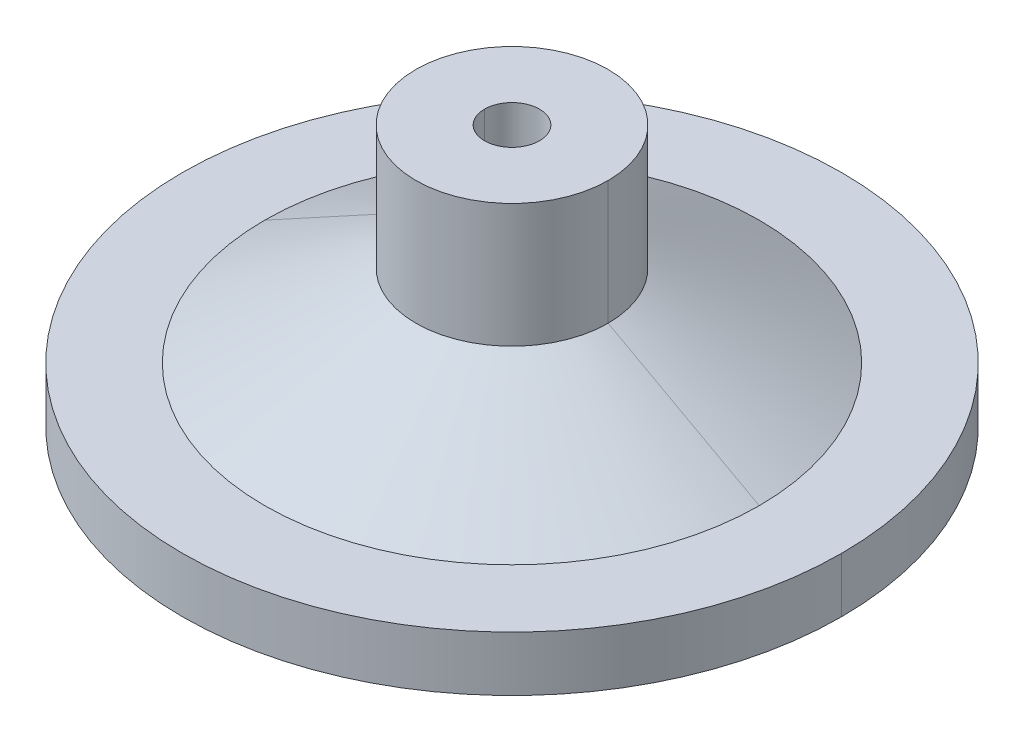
ISO-10303-21;
HEADER;
FILE_DESCRIPTION(('STEP AP214'),'2;1');
FILE_NAME('part.step','',(''),(''),'','','');
FILE_SCHEMA(('AUTOMOTIVE_DESIGN { 1 0 10303 214 1 1 1 1 }'));
ENDSEC;
DATA;
#1=APPLICATION_CONTEXT('core data for automotive mechanical design processes');
#2=APPLICATION_PROTOCOL_DEFINITION('international standard','automotive_design',2000,#1);
#3=PRODUCT_CONTEXT('',#1,'mechanical');
#4=PRODUCT('Part','Part','',(#3));
#5=PRODUCT_RELATED_PRODUCT_CATEGORY('part','',(#4));
#6=PRODUCT_DEFINITION_FORMATION('','',#4);
#7=PRODUCT_DEFINITION_CONTEXT('part definition',#1,'design');
#8=PRODUCT_DEFINITION('design','',#6,#7);
#9=PRODUCT_DEFINITION_SHAPE('','',#8);
#10=(LENGTH_UNIT() NAMED_UNIT(*) SI_UNIT(.MILLI.,.METRE.));
#11=(NAMED_UNIT(*) PLANE_ANGLE_UNIT() SI_UNIT($,.RADIAN.));
#12=(NAMED_UNIT(*) SI_UNIT($,.STERADIAN.) SOLID_ANGLE_UNIT());
#13=UNCERTAINTY_MEASURE_WITH_UNIT(LENGTH_MEASURE(1.E-05),#10,'distance_accuracy_value','');
#14=(GEOMETRIC_REPRESENTATION_CONTEXT(3) GLOBAL_UNCERTAINTY_ASSIGNED_CONTEXT((#13)) GLOBAL_UNIT_ASSIGNED_CONTEXT((#10,
#11,#12)) REPRESENTATION_CONTEXT('',''));
#15=CARTESIAN_POINT('',(0.,0.,0.));
#16=DIRECTION('',(0.,0.,1.));
#17=DIRECTION('',(1.,0.,0.));
#18=AXIS2_PLACEMENT_3D('',#15,#16,#17);
#19=CARTESIAN_POINT('',(8.46666666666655,1.5875,0.));
#20=DIRECTION('',(0.,-1.,0.));
#21=DIRECTION('',(0.,0.,-1.));
#22=AXIS2_PLACEMENT_3D('',#19,#20,#21);
#23=PLANE('',#22);
#24=CARTESIAN_POINT('',(0.,1.58749999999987,0.));
#25=DIRECTION('',(0.,-1.,0.));
#26=DIRECTION('',(0.,0.,-1.));
#27=AXIS2_PLACEMENT_3D('',#24,#25,#26);
#28=CIRCLE('',#27,10.5833333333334);
#29=CARTESIAN_POINT('',(-10.5833333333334,1.58749999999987,0.));
#30=VERTEX_POINT('',#29);
#31=CARTESIAN_POINT('',(10.5833333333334,1.58749999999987,0.));
#32=VERTEX_POINT('',#31);
#33=EDGE_CURVE('E19',#30,#32,#28,.F.);
#34=ORIENTED_EDGE('',*,*,#33,.F.);
#35=CARTESIAN_POINT('',(0.,1.58749999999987,0.));
#36=DIRECTION('',(0.,-1.,0.));
#37=DIRECTION('',(0.,0.,-1.));
#38=AXIS2_PLACEMENT_3D('',#35,#36,#37);
#39=CIRCLE('',#38,10.5833333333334);
#40=EDGE_CURVE('E94',#32,#30,#39,.F.);
#41=ORIENTED_EDGE('',*,*,#40,.F.);
#42=EDGE_LOOP('',(#34,#41));
#43=FACE_BOUND('',#42,.T.);
#44=CARTESIAN_POINT('',(0.,1.5875,0.));
#45=DIRECTION('',(0.,-1.,0.));
#46=DIRECTION('',(0.,0.,-1.));
#47=AXIS2_PLACEMENT_3D('',#44,#45,#46);
#48=CIRCLE('',#47,6.35);
#49=CARTESIAN_POINT('',(6.35,1.5875,0.));
#50=VERTEX_POINT('',#49);
#51=CARTESIAN_POINT('',(-6.35,1.5875,0.));
#52=VERTEX_POINT('',#51);
#53=EDGE_CURVE('E150',#50,#52,#48,.T.);
#54=ORIENTED_EDGE('',*,*,#53,.F.);
#55=CARTESIAN_POINT('',(0.,1.5875,0.));
#56=DIRECTION('',(0.,-1.,0.));
#57=DIRECTION('',(0.,0.,-1.));
#58=AXIS2_PLACEMENT_3D('',#55,#56,#57);
#59=CIRCLE('',#58,6.35);
#60=EDGE_CURVE('E145',#52,#50,#59,.T.);
#61=ORIENTED_EDGE('',*,*,#60,.F.);
#62=EDGE_LOOP('',(#54,#61));
#63=FACE_BOUND('',#62,.T.);
#64=ADVANCED_FACE('F16',(#43,#63),#23,.T.);
#65=CARTESIAN_POINT('',(0.,1.58749999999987,0.));
#66=DIRECTION('',(0.,-1.,0.));
#67=DIRECTION('',(0.,0.,-1.));
#68=AXIS2_PLACEMENT_3D('',#65,#66,#67);
#69=CONICAL_SURFACE('',#68,10.5833333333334,1.07144960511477);
#70=DIRECTION('',(-0.877895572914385,-0.478852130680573,0.));
#71=VECTOR('',#70,1.);
#72=CARTESIAN_POINT('',(-33.8666666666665,-11.1125,0.));
#73=LINE('',#72,#71);
#74=CARTESIAN_POINT('',(-57.15,-23.8125,0.));
#75=VERTEX_POINT('',#74);
#76=EDGE_CURVE('E92',#30,#75,#73,.T.);
#77=ORIENTED_EDGE('',*,*,#76,.F.);
#78=ORIENTED_EDGE('',*,*,#33,.T.);
#79=DIRECTION('',(0.877895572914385,-0.478852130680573,0.));
#80=VECTOR('',#79,1.);
#81=CARTESIAN_POINT('',(33.8666666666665,-11.1125,0.));
#82=LINE('',#81,#80);
#83=CARTESIAN_POINT('',(57.15,-23.8125,0.));
#84=VERTEX_POINT('',#83);
#85=EDGE_CURVE('E89',#84,#32,#82,.F.);
#86=ORIENTED_EDGE('',*,*,#85,.F.);
#87=CARTESIAN_POINT('',(0.,-23.8125,0.));
#88=DIRECTION('',(0.,1.,0.));
#89=DIRECTION('',(1.,0.,0.));
#90=AXIS2_PLACEMENT_3D('',#87,#88,#89);
#91=CIRCLE('',#90,57.15);
#92=EDGE_CURVE('E148',#75,#84,#91,.T.);
#93=ORIENTED_EDGE('',*,*,#92,.F.);
#94=EDGE_LOOP('',(#77,#78,#86,#93));
#95=FACE_BOUND('',#94,.T.);
#96=ADVANCED_FACE('F86',(#95),#69,.F.);
#97=CARTESIAN_POINT('',(0.,1.58749999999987,0.));
#98=DIRECTION('',(0.,-1.,0.));
#99=DIRECTION('',(0.,0.,-1.));
#100=AXIS2_PLACEMENT_3D('',#97,#98,#99);
#101=CONICAL_SURFACE('',#100,10.5833333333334,1.07144960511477);
#102=ORIENTED_EDGE('',*,*,#76,.T.);
#103=CARTESIAN_POINT('',(0.,-23.8125,0.));
#104=DIRECTION('',(0.,1.,0.));
#105=DIRECTION('',(1.,0.,0.));
#106=AXIS2_PLACEMENT_3D('',#103,#104,#105);
#107=CIRCLE('',#106,57.15);
#108=EDGE_CURVE('E100',#84,#75,#107,.T.);
#109=ORIENTED_EDGE('',*,*,#108,.F.);
#110=ORIENTED_EDGE('',*,*,#85,.T.);
#111=ORIENTED_EDGE('',*,*,#40,.T.);
#112=EDGE_LOOP('',(#102,#109,#110,#111));
#113=FACE_BOUND('',#112,.T.);
#114=ADVANCED_FACE('F98',(#113),#101,.F.);
#115=CARTESIAN_POINT('',(0.,30.1625,0.));
#116=DIRECTION('',(0.,-1.,0.));
#117=DIRECTION('',(0.,0.,-1.));
#118=AXIS2_PLACEMENT_3D('',#115,#116,#117);
#119=CYLINDRICAL_SURFACE('',#118,6.35);
#120=DIRECTION('',(0.,-1.,0.));
#121=VECTOR('',#120,1.);
#122=CARTESIAN_POINT('',(-6.35,15.875,0.));
#123=LINE('',#122,#121);
#124=CARTESIAN_POINT('',(-6.35,30.1625,0.));
#125=VERTEX_POINT('',#124);
#126=EDGE_CURVE('E149',#125,#52,#123,.T.);
#127=ORIENTED_EDGE('',*,*,#126,.F.);
#128=CARTESIAN_POINT('',(0.,30.1625,0.));
#129=DIRECTION('',(0.,-1.,0.));
#130=DIRECTION('',(0.,0.,-1.));
#131=AXIS2_PLACEMENT_3D('',#128,#129,#130);
#132=CIRCLE('',#131,6.35);
#133=CARTESIAN_POINT('',(6.35,30.1625,0.));
#134=VERTEX_POINT('',#133);
#135=EDGE_CURVE('E141',#134,#125,#132,.T.);
#136=ORIENTED_EDGE('',*,*,#135,.F.);
#137=DIRECTION('',(0.,-1.,0.));
#138=VECTOR('',#137,1.);
#139=CARTESIAN_POINT('',(6.35,15.875,0.));
#140=LINE('',#139,#138);
#141=EDGE_CURVE('E151',#50,#134,#140,.F.);
#142=ORIENTED_EDGE('',*,*,#141,.F.);
#143=ORIENTED_EDGE('',*,*,#53,.T.);
#144=EDGE_LOOP('',(#127,#136,#142,#143));
#145=FACE_BOUND('',#144,.T.);
#146=ADVANCED_FACE('F304',(#145),#119,.F.);
#147=CARTESIAN_POINT('',(0.,30.1625,0.));
#148=DIRECTION('',(0.,-1.,0.));
#149=DIRECTION('',(0.,0.,-1.));
#150=AXIS2_PLACEMENT_3D('',#147,#148,#149);
#151=CYLINDRICAL_SURFACE('',#150,6.35);
#152=ORIENTED_EDGE('',*,*,#126,.T.);
#153=ORIENTED_EDGE('',*,*,#60,.T.);
#154=ORIENTED_EDGE('',*,*,#141,.T.);
#155=CARTESIAN_POINT('',(0.,30.1625,0.));
#156=DIRECTION('',(0.,-1.,0.));
#157=DIRECTION('',(0.,0.,-1.));
#158=AXIS2_PLACEMENT_3D('',#155,#156,#157);
#159=CIRCLE('',#158,6.35);
#160=EDGE_CURVE('E138',#125,#134,#159,.T.);
#161=ORIENTED_EDGE('',*,*,#160,.F.);
#162=EDGE_LOOP('',(#152,#153,#154,#161));
#163=FACE_BOUND('',#162,.T.);
#164=ADVANCED_FACE('F296',(#163),#151,.F.);
#165=CARTESIAN_POINT('',(0.,-23.8125,0.));
#166=DIRECTION('',(0.,-1.,0.));
#167=DIRECTION('',(0.,0.,-1.));
#168=AXIS2_PLACEMENT_3D('',#165,#166,#167);
#169=CYLINDRICAL_SURFACE('',#168,57.15);
#170=DIRECTION('',(0.,-1.,0.));
#171=VECTOR('',#170,1.);
#172=CARTESIAN_POINT('',(-57.15,-26.9875,0.));
#173=LINE('',#172,#171);
#174=CARTESIAN_POINT('',(-57.15,-30.1625,0.));
#175=VERTEX_POINT('',#174);
#176=EDGE_CURVE('E144',#75,#175,#173,.T.);
#177=ORIENTED_EDGE('',*,*,#176,.F.);
#178=ORIENTED_EDGE('',*,*,#92,.T.);
#179=DIRECTION('',(0.,-1.,0.));
#180=VECTOR('',#179,1.);
#181=CARTESIAN_POINT('',(57.15,-26.9875,0.));
#182=LINE('',#181,#180);
#183=CARTESIAN_POINT('',(57.15,-30.1625,0.));
#184=VERTEX_POINT('',#183);
#185=EDGE_CURVE('E162',#184,#84,#182,.F.);
#186=ORIENTED_EDGE('',*,*,#185,.F.);
#187=CARTESIAN_POINT('',(0.,-30.1625,0.));
#188=DIRECTION('',(0.,-1.,0.));
#189=DIRECTION('',(0.,0.,-1.));
#190=AXIS2_PLACEMENT_3D('',#187,#188,#189);
#191=CIRCLE('',#190,57.15);
#192=EDGE_CURVE('E135',#175,#184,#191,.F.);
#193=ORIENTED_EDGE('',*,*,#192,.F.);
#194=EDGE_LOOP('',(#177,#178,#186,#193));
#195=FACE_BOUND('',#194,.T.);
#196=ADVANCED_FACE('F288',(#195),#169,.F.);
#197=CARTESIAN_POINT('',(0.,-23.8125,0.));
#198=DIRECTION('',(0.,-1.,0.));
#199=DIRECTION('',(0.,0.,-1.));
#200=AXIS2_PLACEMENT_3D('',#197,#198,#199);
#201=CYLINDRICAL_SURFACE('',#200,57.15);
#202=ORIENTED_EDGE('',*,*,#176,.T.);
#203=CARTESIAN_POINT('',(0.,-30.1625,0.));
#204=DIRECTION('',(0.,-1.,0.));
#205=DIRECTION('',(0.,0.,-1.));
#206=AXIS2_PLACEMENT_3D('',#203,#204,#205);
#207=CIRCLE('',#206,57.15);
#208=EDGE_CURVE('E132',#184,#175,#207,.F.);
#209=ORIENTED_EDGE('',*,*,#208,.F.);
#210=ORIENTED_EDGE('',*,*,#185,.T.);
#211=ORIENTED_EDGE('',*,*,#108,.T.);
#212=EDGE_LOOP('',(#202,#209,#210,#211));
#213=FACE_BOUND('',#212,.T.);
#214=ADVANCED_FACE('F280',(#213),#201,.F.);
#215=CARTESIAN_POINT('',(14.2875,30.1625,0.));
#216=DIRECTION('',(0.,1.,0.));
#217=DIRECTION('',(0.,0.,1.));
#218=AXIS2_PLACEMENT_3D('',#215,#216,#217);
#219=PLANE('',#218);
#220=ORIENTED_EDGE('',*,*,#135,.T.);
#221=ORIENTED_EDGE('',*,*,#160,.T.);
#222=EDGE_LOOP('',(#220,#221));
#223=FACE_BOUND('',#222,.T.);
#224=CARTESIAN_POINT('',(0.,30.1625,0.));
#225=DIRECTION('',(0.,-1.,0.));
#226=DIRECTION('',(0.,0.,-1.));
#227=AXIS2_PLACEMENT_3D('',#224,#225,#226);
#228=CIRCLE('',#227,22.225);
#229=CARTESIAN_POINT('',(22.225,30.1625,0.));
#230=VERTEX_POINT('',#229);
#231=CARTESIAN_POINT('',(-22.225,30.1625,0.));
#232=VERTEX_POINT('',#231);
#233=EDGE_CURVE('E129',#230,#232,#228,.T.);
#234=ORIENTED_EDGE('',*,*,#233,.F.);
#235=CARTESIAN_POINT('',(0.,30.1625,0.));
#236=DIRECTION('',(0.,-1.,0.));
#237=DIRECTION('',(0.,0.,-1.));
#238=AXIS2_PLACEMENT_3D('',#235,#236,#237);
#239=CIRCLE('',#238,22.225);
#240=EDGE_CURVE('E125',#232,#230,#239,.T.);
#241=ORIENTED_EDGE('',*,*,#240,.F.);
#242=EDGE_LOOP('',(#234,#241));
#243=FACE_BOUND('',#242,.T.);
#244=ADVANCED_FACE('F272',(#223,#243),#219,.T.);
#245=CARTESIAN_POINT('',(66.675,-30.1625,0.));
#246=DIRECTION('',(0.,-1.,0.));
#247=DIRECTION('',(0.,0.,-1.));
#248=AXIS2_PLACEMENT_3D('',#245,#246,#247);
#249=PLANE('',#248);
#250=CARTESIAN_POINT('',(0.,-30.1625,0.));
#251=DIRECTION('',(0.,-1.,0.));
#252=DIRECTION('',(0.,0.,-1.));
#253=AXIS2_PLACEMENT_3D('',#250,#251,#252);
#254=CIRCLE('',#253,76.2);
#255=CARTESIAN_POINT('',(-76.2,-30.1625,0.));
#256=VERTEX_POINT('',#255);
#257=CARTESIAN_POINT('',(76.2,-30.1625,0.));
#258=VERTEX_POINT('',#257);
#259=EDGE_CURVE('E123',#256,#258,#254,.F.);
#260=ORIENTED_EDGE('',*,*,#259,.F.);
#261=CARTESIAN_POINT('',(0.,-30.1625,0.));
#262=DIRECTION('',(0.,-1.,0.));
#263=DIRECTION('',(0.,0.,-1.));
#264=AXIS2_PLACEMENT_3D('',#261,#262,#263);
#265=CIRCLE('',#264,76.2);
#266=EDGE_CURVE('E118',#258,#256,#265,.F.);
#267=ORIENTED_EDGE('',*,*,#266,.F.);
#268=EDGE_LOOP('',(#260,#267));
#269=FACE_BOUND('',#268,.T.);
#270=ORIENTED_EDGE('',*,*,#192,.T.);
#271=ORIENTED_EDGE('',*,*,#208,.T.);
#272=EDGE_LOOP('',(#270,#271));
#273=FACE_BOUND('',#272,.T.);
#274=ADVANCED_FACE('F264',(#269,#273),#249,.T.);
#275=CARTESIAN_POINT('',(0.,15.875,0.));
#276=DIRECTION('',(0.,-1.,0.));
#277=DIRECTION('',(0.,0.,-1.));
#278=AXIS2_PLACEMENT_3D('',#275,#276,#277);
#279=CYLINDRICAL_SURFACE('',#278,22.225);
#280=DIRECTION('',(0.,-1.,0.));
#281=VECTOR('',#280,1.);
#282=CARTESIAN_POINT('',(-22.225,15.875,0.));
#283=LINE('',#282,#281);
#284=CARTESIAN_POINT('',(-22.225,1.5875,0.));
#285=VERTEX_POINT('',#284);
#286=EDGE_CURVE('E128',#285,#232,#283,.F.);
#287=ORIENTED_EDGE('',*,*,#286,.F.);
#288=CARTESIAN_POINT('',(0.,1.5875,0.));
#289=DIRECTION('',(0.,-1.,0.));
#290=DIRECTION('',(1.,0.,0.));
#291=AXIS2_PLACEMENT_3D('',#288,#289,#290);
#292=CIRCLE('',#291,22.225);
#293=CARTESIAN_POINT('',(22.225,1.5875,0.));
#294=VERTEX_POINT('',#293);
#295=EDGE_CURVE('E189',#294,#285,#292,.T.);
#296=ORIENTED_EDGE('',*,*,#295,.F.);
#297=DIRECTION('',(0.,-1.,0.));
#298=VECTOR('',#297,1.);
#299=CARTESIAN_POINT('',(22.225,15.875,0.));
#300=LINE('',#299,#298);
#301=EDGE_CURVE('E131',#230,#294,#300,.T.);
#302=ORIENTED_EDGE('',*,*,#301,.F.);
#303=ORIENTED_EDGE('',*,*,#233,.T.);
#304=EDGE_LOOP('',(#287,#296,#302,#303));
#305=FACE_BOUND('',#304,.T.);
#306=ADVANCED_FACE('F256',(#305),#279,.T.);
#307=CARTESIAN_POINT('',(0.,15.875,0.));
#308=DIRECTION('',(0.,-1.,0.));
#309=DIRECTION('',(0.,0.,-1.));
#310=AXIS2_PLACEMENT_3D('',#307,#308,#309);
#311=CYLINDRICAL_SURFACE('',#310,22.225);
#312=ORIENTED_EDGE('',*,*,#286,.T.);
#313=ORIENTED_EDGE('',*,*,#240,.T.);
#314=ORIENTED_EDGE('',*,*,#301,.T.);
#315=CARTESIAN_POINT('',(0.,1.5875,0.));
#316=DIRECTION('',(0.,-1.,0.));
#317=DIRECTION('',(1.,0.,0.));
#318=AXIS2_PLACEMENT_3D('',#315,#316,#317);
#319=CIRCLE('',#318,22.225);
#320=EDGE_CURVE('E117',#285,#294,#319,.T.);
#321=ORIENTED_EDGE('',*,*,#320,.F.);
#322=EDGE_LOOP('',(#312,#313,#314,#321));
#323=FACE_BOUND('',#322,.T.);
#324=ADVANCED_FACE('F248',(#323),#311,.T.);
#325=CARTESIAN_POINT('',(0.,-23.8125,0.));
#326=DIRECTION('',(0.,-1.,0.));
#327=DIRECTION('',(0.,0.,-1.));
#328=AXIS2_PLACEMENT_3D('',#325,#326,#327);
#329=CYLINDRICAL_SURFACE('',#328,76.2);
#330=DIRECTION('',(0.,-1.,0.));
#331=VECTOR('',#330,1.);
#332=CARTESIAN_POINT('',(-76.2,-23.8125,0.));
#333=LINE('',#332,#331);
#334=CARTESIAN_POINT('',(-76.2,-17.4625,0.));
#335=VERTEX_POINT('',#334);
#336=EDGE_CURVE('E121',#256,#335,#333,.F.);
#337=ORIENTED_EDGE('',*,*,#336,.F.);
#338=ORIENTED_EDGE('',*,*,#259,.T.);
#339=DIRECTION('',(0.,-1.,0.));
#340=VECTOR('',#339,1.);
#341=CARTESIAN_POINT('',(76.2,-23.8125,0.));
#342=LINE('',#341,#340);
#343=CARTESIAN_POINT('',(76.2,-17.4625,0.));
#344=VERTEX_POINT('',#343);
#345=EDGE_CURVE('E122',#344,#258,#342,.T.);
#346=ORIENTED_EDGE('',*,*,#345,.F.);
#347=CARTESIAN_POINT('',(0.,-17.4625,0.));
#348=DIRECTION('',(0.,-1.,0.));
#349=DIRECTION('',(0.,0.,-1.));
#350=AXIS2_PLACEMENT_3D('',#347,#348,#349);
#351=CIRCLE('',#350,76.2);
#352=EDGE_CURVE('E114',#335,#344,#351,.F.);
#353=ORIENTED_EDGE('',*,*,#352,.F.);
#354=EDGE_LOOP('',(#337,#338,#346,#353));
#355=FACE_BOUND('',#354,.T.);
#356=ADVANCED_FACE('F219',(#355),#329,.T.);
#357=CARTESIAN_POINT('',(0.,-23.8125,0.));
#358=DIRECTION('',(0.,-1.,0.));
#359=DIRECTION('',(0.,0.,-1.));
#360=AXIS2_PLACEMENT_3D('',#357,#358,#359);
#361=CYLINDRICAL_SURFACE('',#360,76.2);
#362=ORIENTED_EDGE('',*,*,#336,.T.);
#363=CARTESIAN_POINT('',(0.,-17.4625,0.));
#364=DIRECTION('',(0.,-1.,0.));
#365=DIRECTION('',(0.,0.,-1.));
#366=AXIS2_PLACEMENT_3D('',#363,#364,#365);
#367=CIRCLE('',#366,76.2);
#368=EDGE_CURVE('E111',#344,#335,#367,.F.);
#369=ORIENTED_EDGE('',*,*,#368,.F.);
#370=ORIENTED_EDGE('',*,*,#345,.T.);
#371=ORIENTED_EDGE('',*,*,#266,.T.);
#372=EDGE_LOOP('',(#362,#369,#370,#371));
#373=FACE_BOUND('',#372,.T.);
#374=ADVANCED_FACE('F211',(#373),#361,.T.);
#375=CARTESIAN_POINT('',(0.,-17.4625,0.));
#376=DIRECTION('',(0.,-1.,0.));
#377=DIRECTION('',(0.,0.,-1.));
#378=AXIS2_PLACEMENT_3D('',#375,#376,#377);
#379=CONICAL_SURFACE('',#378,57.15,1.07144960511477);
#380=DIRECTION('',(0.877895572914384,0.478852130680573,0.));
#381=VECTOR('',#380,1.);
#382=CARTESIAN_POINT('',(-39.6875,-7.9375,0.));
#383=LINE('',#382,#381);
#384=CARTESIAN_POINT('',(-57.15,-17.4625,0.));
#385=VERTEX_POINT('',#384);
#386=EDGE_CURVE('E34',#385,#285,#383,.T.);
#387=ORIENTED_EDGE('',*,*,#386,.F.);
#388=CARTESIAN_POINT('',(0.,-17.4625,0.));
#389=DIRECTION('',(0.,-1.,0.));
#390=DIRECTION('',(0.,0.,-1.));
#391=AXIS2_PLACEMENT_3D('',#388,#389,#390);
#392=CIRCLE('',#391,57.15);
#393=CARTESIAN_POINT('',(57.15,-17.4625,0.));
#394=VERTEX_POINT('',#393);
#395=EDGE_CURVE('E25',#394,#385,#392,.T.);
#396=ORIENTED_EDGE('',*,*,#395,.F.);
#397=DIRECTION('',(-0.877895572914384,0.478852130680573,0.));
#398=VECTOR('',#397,1.);
#399=CARTESIAN_POINT('',(39.6875,-7.9375,0.));
#400=LINE('',#399,#398);
#401=EDGE_CURVE('E191',#294,#394,#400,.F.);
#402=ORIENTED_EDGE('',*,*,#401,.F.);
#403=ORIENTED_EDGE('',*,*,#295,.T.);
#404=EDGE_LOOP('',(#387,#396,#402,#403));
#405=FACE_BOUND('',#404,.T.);
#406=ADVANCED_FACE('F209',(#405),#379,.T.);
#407=CARTESIAN_POINT('',(0.,-17.4625,0.));
#408=DIRECTION('',(0.,-1.,0.));
#409=DIRECTION('',(0.,0.,-1.));
#410=AXIS2_PLACEMENT_3D('',#407,#408,#409);
#411=CONICAL_SURFACE('',#410,57.15,1.07144960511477);
#412=ORIENTED_EDGE('',*,*,#386,.T.);
#413=ORIENTED_EDGE('',*,*,#320,.T.);
#414=ORIENTED_EDGE('',*,*,#401,.T.);
#415=CARTESIAN_POINT('',(0.,-17.4625,0.));
#416=DIRECTION('',(0.,-1.,0.));
#417=DIRECTION('',(0.,0.,-1.));
#418=AXIS2_PLACEMENT_3D('',#415,#416,#417);
#419=CIRCLE('',#418,57.15);
#420=EDGE_CURVE('E11',#385,#394,#419,.T.);
#421=ORIENTED_EDGE('',*,*,#420,.F.);
#422=EDGE_LOOP('',(#412,#413,#414,#421));
#423=FACE_BOUND('',#422,.T.);
#424=ADVANCED_FACE('F204',(#423),#411,.T.);
#425=CARTESIAN_POINT('',(66.675,-17.4625,0.));
#426=DIRECTION('',(0.,1.,0.));
#427=DIRECTION('',(0.,0.,1.));
#428=AXIS2_PLACEMENT_3D('',#425,#426,#427);
#429=PLANE('',#428);
#430=ORIENTED_EDGE('',*,*,#395,.T.);
#431=ORIENTED_EDGE('',*,*,#420,.T.);
#432=EDGE_LOOP('',(#430,#431));
#433=FACE_BOUND('',#432,.T.);
#434=ORIENTED_EDGE('',*,*,#352,.T.);
#435=ORIENTED_EDGE('',*,*,#368,.T.);
#436=EDGE_LOOP('',(#434,#435));
#437=FACE_BOUND('',#436,.T.);
#438=ADVANCED_FACE('F207',(#433,#437),#429,.T.);
#439=CLOSED_SHELL('',(#64,#96,#114,#146,#164,#196,#214,#244,#274,#306,#324,#356,#374,#406,#424,#438));
#440=MANIFOLD_SOLID_BREP('B1',#439);
#441=ADVANCED_BREP_SHAPE_REPRESENTATION('',(#18,#440),#14);
#442=SHAPE_DEFINITION_REPRESENTATION(#9,#441);
ENDSEC;
END-ISO-10303-21;
